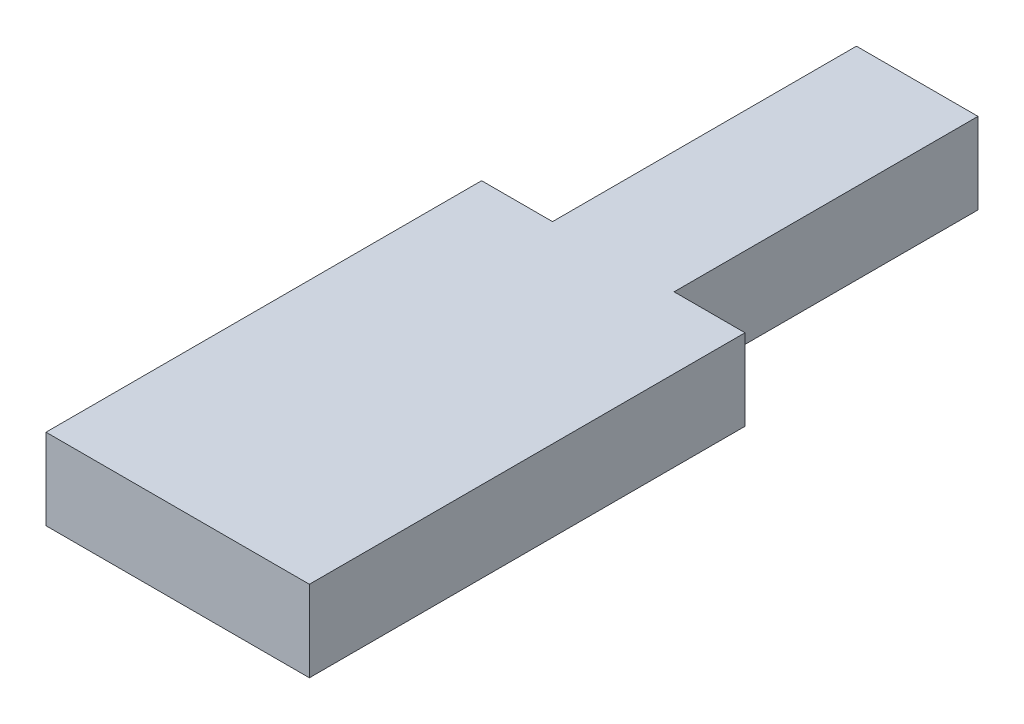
ISO-10303-21;
HEADER;
FILE_DESCRIPTION(('STEP AP214'),'2;1');
FILE_NAME('part.step','',(''),(''),'','','');
FILE_SCHEMA(('AUTOMOTIVE_DESIGN { 1 0 10303 214 1 1 1 1 }'));
ENDSEC;
DATA;
#1=APPLICATION_CONTEXT('core data for automotive mechanical design processes');
#2=APPLICATION_PROTOCOL_DEFINITION('international standard','automotive_design',2000,#1);
#3=PRODUCT_CONTEXT('',#1,'mechanical');
#4=PRODUCT('Part','Part','',(#3));
#5=PRODUCT_RELATED_PRODUCT_CATEGORY('part','',(#4));
#6=PRODUCT_DEFINITION_FORMATION('','',#4);
#7=PRODUCT_DEFINITION_CONTEXT('part definition',#1,'design');
#8=PRODUCT_DEFINITION('design','',#6,#7);
#9=PRODUCT_DEFINITION_SHAPE('','',#8);
#10=(LENGTH_UNIT() NAMED_UNIT(*) SI_UNIT(.MILLI.,.METRE.));
#11=(NAMED_UNIT(*) PLANE_ANGLE_UNIT() SI_UNIT($,.RADIAN.));
#12=(NAMED_UNIT(*) SI_UNIT($,.STERADIAN.) SOLID_ANGLE_UNIT());
#13=UNCERTAINTY_MEASURE_WITH_UNIT(LENGTH_MEASURE(1.E-05),#10,'distance_accuracy_value','');
#14=(GEOMETRIC_REPRESENTATION_CONTEXT(3) GLOBAL_UNCERTAINTY_ASSIGNED_CONTEXT((#13)) GLOBAL_UNIT_ASSIGNED_CONTEXT((#10,
#11,#12)) REPRESENTATION_CONTEXT('',''));
#15=CARTESIAN_POINT('',(0.,0.,0.));
#16=DIRECTION('',(0.,0.,1.));
#17=DIRECTION('',(1.,0.,0.));
#18=AXIS2_PLACEMENT_3D('',#15,#16,#17);
#19=CARTESIAN_POINT('',(8.500000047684,1.9,-3.));
#20=DIRECTION('',(1.,0.,0.));
#21=DIRECTION('',(0.,0.,-1.));
#22=AXIS2_PLACEMENT_3D('',#19,#20,#21);
#23=PLANE('',#22);
#24=DIRECTION('',(0.,0.,1.));
#25=VECTOR('',#24,1.);
#26=CARTESIAN_POINT('',(8.500000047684,2.700000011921,-3.));
#27=LINE('',#26,#25);
#28=CARTESIAN_POINT('',(8.500000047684,2.700000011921,0.));
#29=VERTEX_POINT('',#28);
#30=CARTESIAN_POINT('',(8.500000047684,2.700000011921,-3.));
#31=VERTEX_POINT('',#30);
#32=EDGE_CURVE('E83',#29,#31,#27,.F.);
#33=ORIENTED_EDGE('',*,*,#32,.F.);
#34=DIRECTION('',(0.,1.,0.));
#35=VECTOR('',#34,1.);
#36=CARTESIAN_POINT('',(8.500000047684,1.9,0.));
#37=LINE('',#36,#35);
#38=CARTESIAN_POINT('',(8.500000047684,1.9,0.));
#39=VERTEX_POINT('',#38);
#40=EDGE_CURVE('E20',#29,#39,#37,.F.);
#41=ORIENTED_EDGE('',*,*,#40,.T.);
#42=DIRECTION('',(0.,0.,1.));
#43=VECTOR('',#42,1.);
#44=CARTESIAN_POINT('',(8.500000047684,1.9,-3.));
#45=LINE('',#44,#43);
#46=CARTESIAN_POINT('',(8.500000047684,1.9,-3.));
#47=VERTEX_POINT('',#46);
#48=EDGE_CURVE('E78',#39,#47,#45,.F.);
#49=ORIENTED_EDGE('',*,*,#48,.T.);
#50=DIRECTION('',(0.,1.,0.));
#51=VECTOR('',#50,1.);
#52=CARTESIAN_POINT('',(8.500000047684,1.9,-3.));
#53=LINE('',#52,#51);
#54=EDGE_CURVE('E92',#47,#31,#53,.T.);
#55=ORIENTED_EDGE('',*,*,#54,.T.);
#56=EDGE_LOOP('',(#33,#41,#49,#55));
#57=FACE_BOUND('',#56,.T.);
#58=ADVANCED_FACE('F17',(#57),#23,.T.);
#59=CARTESIAN_POINT('',(7.3,1.9,-3.));
#60=DIRECTION('',(0.,0.,1.));
#61=DIRECTION('',(1.,0.,0.));
#62=AXIS2_PLACEMENT_3D('',#59,#60,#61);
#63=PLANE('',#62);
#64=ORIENTED_EDGE('',*,*,#54,.F.);
#65=DIRECTION('',(1.,0.,0.));
#66=VECTOR('',#65,1.);
#67=CARTESIAN_POINT('',(7.3,1.9,-3.));
#68=LINE('',#67,#66);
#69=CARTESIAN_POINT('',(7.3,1.9,-3.));
#70=VERTEX_POINT('',#69);
#71=EDGE_CURVE('E91',#70,#47,#68,.T.);
#72=ORIENTED_EDGE('',*,*,#71,.F.);
#73=DIRECTION('',(0.,1.,0.));
#74=VECTOR('',#73,1.);
#75=CARTESIAN_POINT('',(7.3,1.9,-3.));
#76=LINE('',#75,#74);
#77=CARTESIAN_POINT('',(7.3,2.700000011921,-3.));
#78=VERTEX_POINT('',#77);
#79=EDGE_CURVE('E101',#70,#78,#76,.T.);
#80=ORIENTED_EDGE('',*,*,#79,.T.);
#81=DIRECTION('',(1.,0.,0.));
#82=VECTOR('',#81,1.);
#83=CARTESIAN_POINT('',(7.3,2.700000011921,-3.));
#84=LINE('',#83,#82);
#85=EDGE_CURVE('E96',#31,#78,#84,.F.);
#86=ORIENTED_EDGE('',*,*,#85,.F.);
#87=EDGE_LOOP('',(#64,#72,#80,#86));
#88=FACE_BOUND('',#87,.T.);
#89=ADVANCED_FACE('F160',(#88),#63,.F.);
#90=CARTESIAN_POINT('',(7.3,1.9,-3.));
#91=DIRECTION('',(1.,0.,0.));
#92=DIRECTION('',(0.,0.,-1.));
#93=AXIS2_PLACEMENT_3D('',#90,#91,#92);
#94=PLANE('',#93);
#95=DIRECTION('',(0.,0.,-1.));
#96=VECTOR('',#95,1.);
#97=CARTESIAN_POINT('',(7.3,2.700000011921,-3.));
#98=LINE('',#97,#96);
#99=CARTESIAN_POINT('',(7.3,2.700000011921,0.));
#100=VERTEX_POINT('',#99);
#101=EDGE_CURVE('E104',#78,#100,#98,.F.);
#102=ORIENTED_EDGE('',*,*,#101,.F.);
#103=ORIENTED_EDGE('',*,*,#79,.F.);
#104=DIRECTION('',(0.,0.,-1.));
#105=VECTOR('',#104,1.);
#106=CARTESIAN_POINT('',(7.3,1.9,-3.));
#107=LINE('',#106,#105);
#108=CARTESIAN_POINT('',(7.3,1.9,0.));
#109=VERTEX_POINT('',#108);
#110=EDGE_CURVE('E99',#109,#70,#107,.T.);
#111=ORIENTED_EDGE('',*,*,#110,.F.);
#112=DIRECTION('',(0.,1.,0.));
#113=VECTOR('',#112,1.);
#114=CARTESIAN_POINT('',(7.3,1.9,0.));
#115=LINE('',#114,#113);
#116=EDGE_CURVE('E111',#109,#100,#115,.T.);
#117=ORIENTED_EDGE('',*,*,#116,.T.);
#118=EDGE_LOOP('',(#102,#103,#111,#117));
#119=FACE_BOUND('',#118,.T.);
#120=ADVANCED_FACE('F156',(#119),#94,.F.);
#121=CARTESIAN_POINT('',(6.6,2.700000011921,0.));
#122=DIRECTION('',(0.,1.,0.));
#123=DIRECTION('',(0.,0.,1.));
#124=AXIS2_PLACEMENT_3D('',#121,#122,#123);
#125=PLANE('',#124);
#126=DIRECTION('',(1.,0.,0.));
#127=VECTOR('',#126,1.);
#128=CARTESIAN_POINT('',(6.6,2.700000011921,0.));
#129=LINE('',#128,#127);
#130=CARTESIAN_POINT('',(9.199999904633,2.700000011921,0.));
#131=VERTEX_POINT('',#130);
#132=EDGE_CURVE('E107',#131,#29,#129,.F.);
#133=ORIENTED_EDGE('',*,*,#132,.T.);
#134=ORIENTED_EDGE('',*,*,#32,.T.);
#135=ORIENTED_EDGE('',*,*,#85,.T.);
#136=ORIENTED_EDGE('',*,*,#101,.T.);
#137=DIRECTION('',(1.,0.,0.));
#138=VECTOR('',#137,1.);
#139=CARTESIAN_POINT('',(6.6,2.700000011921,0.));
#140=LINE('',#139,#138);
#141=CARTESIAN_POINT('',(6.6,2.700000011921,0.));
#142=VERTEX_POINT('',#141);
#143=EDGE_CURVE('E109',#100,#142,#140,.F.);
#144=ORIENTED_EDGE('',*,*,#143,.T.);
#145=DIRECTION('',(0.,0.,-1.));
#146=VECTOR('',#145,1.);
#147=CARTESIAN_POINT('',(6.6,2.700000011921,0.));
#148=LINE('',#147,#146);
#149=CARTESIAN_POINT('',(6.6,2.700000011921,4.300000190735));
#150=VERTEX_POINT('',#149);
#151=EDGE_CURVE('E117',#142,#150,#148,.F.);
#152=ORIENTED_EDGE('',*,*,#151,.T.);
#153=DIRECTION('',(1.,0.,0.));
#154=VECTOR('',#153,1.);
#155=CARTESIAN_POINT('',(6.6,2.700000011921,4.300000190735));
#156=LINE('',#155,#154);
#157=CARTESIAN_POINT('',(9.199999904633,2.700000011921,4.300000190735));
#158=VERTEX_POINT('',#157);
#159=EDGE_CURVE('E121',#158,#150,#156,.F.);
#160=ORIENTED_EDGE('',*,*,#159,.F.);
#161=DIRECTION('',(0.,0.,-1.));
#162=VECTOR('',#161,1.);
#163=CARTESIAN_POINT('',(9.199999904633,2.700000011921,0.));
#164=LINE('',#163,#162);
#165=EDGE_CURVE('E124',#131,#158,#164,.F.);
#166=ORIENTED_EDGE('',*,*,#165,.F.);
#167=EDGE_LOOP('',(#133,#134,#135,#136,#144,#152,#160,#166));
#168=FACE_BOUND('',#167,.T.);
#169=ADVANCED_FACE('F162',(#168),#125,.T.);
#170=CARTESIAN_POINT('',(6.6,1.9,0.));
#171=DIRECTION('',(0.,0.,1.));
#172=DIRECTION('',(1.,0.,0.));
#173=AXIS2_PLACEMENT_3D('',#170,#171,#172);
#174=PLANE('',#173);
#175=DIRECTION('',(1.,0.,0.));
#176=VECTOR('',#175,1.);
#177=CARTESIAN_POINT('',(6.6,1.9,0.));
#178=LINE('',#177,#176);
#179=CARTESIAN_POINT('',(6.6,1.9,0.));
#180=VERTEX_POINT('',#179);
#181=EDGE_CURVE('E129',#109,#180,#178,.F.);
#182=ORIENTED_EDGE('',*,*,#181,.T.);
#183=DIRECTION('',(0.,1.,0.));
#184=VECTOR('',#183,1.);
#185=CARTESIAN_POINT('',(6.6,1.9,0.));
#186=LINE('',#185,#184);
#187=EDGE_CURVE('E114',#180,#142,#186,.T.);
#188=ORIENTED_EDGE('',*,*,#187,.T.);
#189=ORIENTED_EDGE('',*,*,#143,.F.);
#190=ORIENTED_EDGE('',*,*,#116,.F.);
#191=EDGE_LOOP('',(#182,#188,#189,#190));
#192=FACE_BOUND('',#191,.T.);
#193=ADVANCED_FACE('F153',(#192),#174,.F.);
#194=CARTESIAN_POINT('',(6.6,1.9,0.));
#195=DIRECTION('',(1.,0.,0.));
#196=DIRECTION('',(0.,0.,-1.));
#197=AXIS2_PLACEMENT_3D('',#194,#195,#196);
#198=PLANE('',#197);
#199=ORIENTED_EDGE('',*,*,#151,.F.);
#200=ORIENTED_EDGE('',*,*,#187,.F.);
#201=DIRECTION('',(0.,0.,1.));
#202=VECTOR('',#201,1.);
#203=CARTESIAN_POINT('',(6.6,1.9,0.));
#204=LINE('',#203,#202);
#205=CARTESIAN_POINT('',(6.6,1.9,4.300000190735));
#206=VERTEX_POINT('',#205);
#207=EDGE_CURVE('E132',#180,#206,#204,.T.);
#208=ORIENTED_EDGE('',*,*,#207,.T.);
#209=DIRECTION('',(0.,1.,0.));
#210=VECTOR('',#209,1.);
#211=CARTESIAN_POINT('',(6.6,1.9,4.300000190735));
#212=LINE('',#211,#210);
#213=EDGE_CURVE('E119',#150,#206,#212,.F.);
#214=ORIENTED_EDGE('',*,*,#213,.F.);
#215=EDGE_LOOP('',(#199,#200,#208,#214));
#216=FACE_BOUND('',#215,.T.);
#217=ADVANCED_FACE('F149',(#216),#198,.F.);
#218=CARTESIAN_POINT('',(6.6,1.9,4.300000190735));
#219=DIRECTION('',(0.,0.,1.));
#220=DIRECTION('',(1.,0.,0.));
#221=AXIS2_PLACEMENT_3D('',#218,#219,#220);
#222=PLANE('',#221);
#223=DIRECTION('',(0.,1.,0.));
#224=VECTOR('',#223,1.);
#225=CARTESIAN_POINT('',(9.199999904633,1.9,4.300000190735));
#226=LINE('',#225,#224);
#227=CARTESIAN_POINT('',(9.199999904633,1.9,4.300000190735));
#228=VERTEX_POINT('',#227);
#229=EDGE_CURVE('E126',#158,#228,#226,.F.);
#230=ORIENTED_EDGE('',*,*,#229,.F.);
#231=ORIENTED_EDGE('',*,*,#159,.T.);
#232=ORIENTED_EDGE('',*,*,#213,.T.);
#233=DIRECTION('',(1.,0.,0.));
#234=VECTOR('',#233,1.);
#235=CARTESIAN_POINT('',(6.6,1.9,4.300000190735));
#236=LINE('',#235,#234);
#237=EDGE_CURVE('E135',#206,#228,#236,.T.);
#238=ORIENTED_EDGE('',*,*,#237,.T.);
#239=EDGE_LOOP('',(#230,#231,#232,#238));
#240=FACE_BOUND('',#239,.T.);
#241=ADVANCED_FACE('F144',(#240),#222,.T.);
#242=CARTESIAN_POINT('',(9.199999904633,1.9,0.));
#243=DIRECTION('',(1.,0.,0.));
#244=DIRECTION('',(0.,0.,-1.));
#245=AXIS2_PLACEMENT_3D('',#242,#243,#244);
#246=PLANE('',#245);
#247=ORIENTED_EDGE('',*,*,#165,.T.);
#248=ORIENTED_EDGE('',*,*,#229,.T.);
#249=DIRECTION('',(0.,0.,1.));
#250=VECTOR('',#249,1.);
#251=CARTESIAN_POINT('',(9.199999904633,1.9,0.));
#252=LINE('',#251,#250);
#253=CARTESIAN_POINT('',(9.199999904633,1.9,0.));
#254=VERTEX_POINT('',#253);
#255=EDGE_CURVE('E26',#228,#254,#252,.F.);
#256=ORIENTED_EDGE('',*,*,#255,.T.);
#257=DIRECTION('',(0.,1.,0.));
#258=VECTOR('',#257,1.);
#259=CARTESIAN_POINT('',(9.199999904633,1.9,0.));
#260=LINE('',#259,#258);
#261=EDGE_CURVE('E34',#254,#131,#260,.T.);
#262=ORIENTED_EDGE('',*,*,#261,.T.);
#263=EDGE_LOOP('',(#247,#248,#256,#262));
#264=FACE_BOUND('',#263,.T.);
#265=ADVANCED_FACE('F139',(#264),#246,.T.);
#266=CARTESIAN_POINT('',(6.6,1.9,0.));
#267=DIRECTION('',(0.,0.,1.));
#268=DIRECTION('',(1.,0.,0.));
#269=AXIS2_PLACEMENT_3D('',#266,#267,#268);
#270=PLANE('',#269);
#271=DIRECTION('',(1.,0.,0.));
#272=VECTOR('',#271,1.);
#273=CARTESIAN_POINT('',(6.6,1.9,0.));
#274=LINE('',#273,#272);
#275=EDGE_CURVE('E11',#254,#39,#274,.F.);
#276=ORIENTED_EDGE('',*,*,#275,.T.);
#277=ORIENTED_EDGE('',*,*,#40,.F.);
#278=ORIENTED_EDGE('',*,*,#132,.F.);
#279=ORIENTED_EDGE('',*,*,#261,.F.);
#280=EDGE_LOOP('',(#276,#277,#278,#279));
#281=FACE_BOUND('',#280,.T.);
#282=ADVANCED_FACE('F84',(#281),#270,.F.);
#283=CARTESIAN_POINT('',(6.6,1.9,0.));
#284=DIRECTION('',(0.,1.,0.));
#285=DIRECTION('',(0.,0.,1.));
#286=AXIS2_PLACEMENT_3D('',#283,#284,#285);
#287=PLANE('',#286);
#288=ORIENTED_EDGE('',*,*,#275,.F.);
#289=ORIENTED_EDGE('',*,*,#255,.F.);
#290=ORIENTED_EDGE('',*,*,#237,.F.);
#291=ORIENTED_EDGE('',*,*,#207,.F.);
#292=ORIENTED_EDGE('',*,*,#181,.F.);
#293=ORIENTED_EDGE('',*,*,#110,.T.);
#294=ORIENTED_EDGE('',*,*,#71,.T.);
#295=ORIENTED_EDGE('',*,*,#48,.F.);
#296=EDGE_LOOP('',(#288,#289,#290,#291,#292,#293,#294,#295));
#297=FACE_BOUND('',#296,.T.);
#298=ADVANCED_FACE('F89',(#297),#287,.F.);
#299=CLOSED_SHELL('',(#58,#89,#120,#169,#193,#217,#241,#265,#282,#298));
#300=MANIFOLD_SOLID_BREP('B1',#299);
#301=ADVANCED_BREP_SHAPE_REPRESENTATION('',(#18,#300),#14);
#302=SHAPE_DEFINITION_REPRESENTATION(#9,#301);
ENDSEC;
END-ISO-10303-21;
